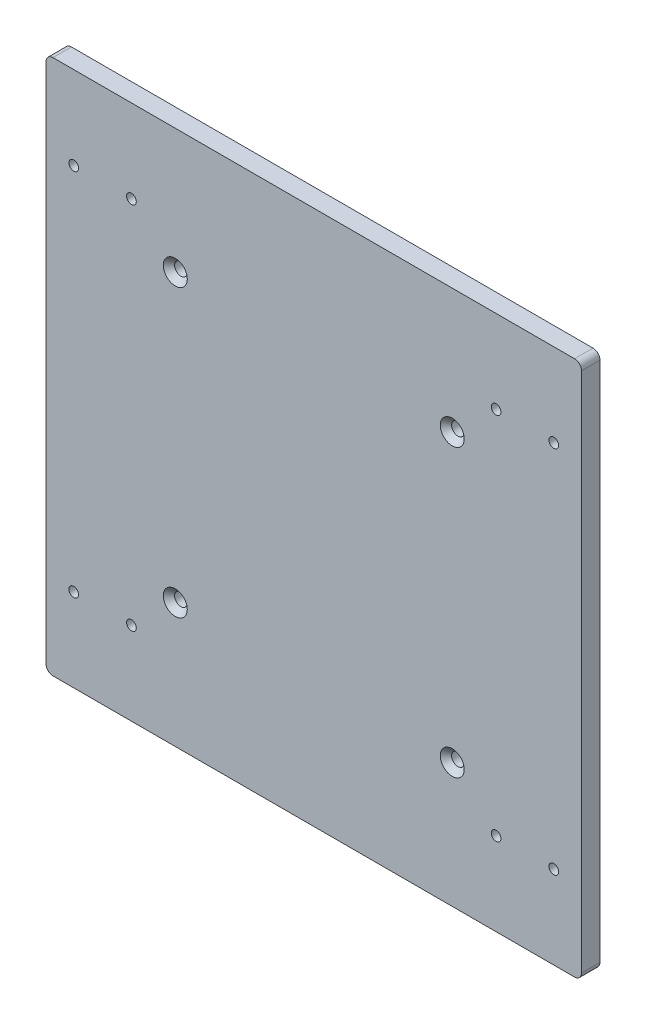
from build123d import *

# Parameters (mm, degrees)
SZKIC1_W                                             = 232
SZKIC1_H                                             = 232
DODANIE_WYCI_GNI_CIE1_DEPTH                          = 8
POG_BIENIE_STO_KOWE_POD_M5_WKR_T_DO_CZ_C_D           = 5.5
POG_BIENIE_STO_KOWE_POD_M5_WKR_T_DO_CZ_C_CSINK_D     = 10.4
POG_BIENIE_STO_KOWE_POD_M5_WKR_T_DO_CZ_C_CSINK_ANGLE = 90
ZAOKR_GLENIE1_R                                      = 3
OTW_R_GWINTOWANY_M5X0_81_D                           = 4.2


with BuildPart() as part:
    # Szkic1 → Dodanie-wyci_gni_cie1 (new body)
    with BuildSketch(Plane.XY):
        Rectangle(SZKIC1_W, SZKIC1_H)
    extrude(amount=DODANIE_WYCI_GNI_CIE1_DEPTH)

    # Pog_bienie sto_kowe pod M5 wkr_t do cz_c (through all)
    with Locations(Plane.XY.offset(8)):
        with Locations((60, 62), (-60, -62), (-60, 62), (60, -62)):
            CounterSinkHole(POG_BIENIE_STO_KOWE_POD_M5_WKR_T_DO_CZ_C_D / 2, POG_BIENIE_STO_KOWE_POD_M5_WKR_T_DO_CZ_C_CSINK_D / 2, counter_sink_angle=POG_BIENIE_STO_KOWE_POD_M5_WKR_T_DO_CZ_C_CSINK_ANGLE)

    # Zaokr_glenie1
    zaokr_glenie1_edges = [part.edges().sort_by_distance(p)[0] for p in [
        (-116, 116, 4),
        (116, 116, 4),
        (116, -116, 4),
        (-116, -116, 4),
    ]]
    fillet(zaokr_glenie1_edges, radius=ZAOKR_GLENIE1_R)

    # Otw_r gwintowany M5x0.81 (through all)
    with Locations(Plane(origin=(0, 0, 0), x_dir=(-1, 0, 0), z_dir=(0, 0, -1))):
        with Locations((79, -80), (104, -80), (-79, -80), (-104, -80), (-79, 80), (-104, 80), (104, 80), (79, 80)):
            Hole(OTW_R_GWINTOWANY_M5X0_81_D / 2)


solid = part.part
